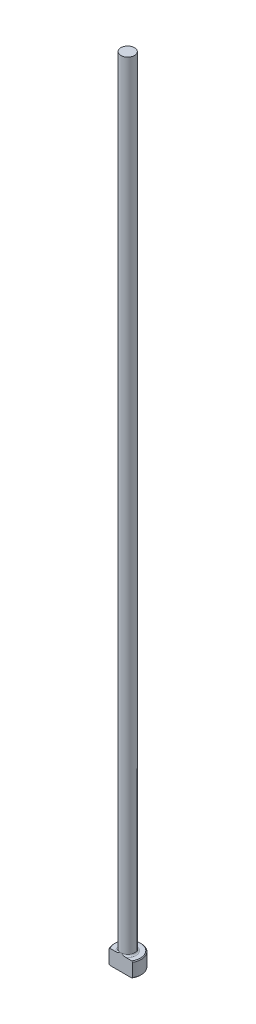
ISO-10303-21;
HEADER;
FILE_DESCRIPTION(('STEP AP214'),'2;1');
FILE_NAME('part.step','',(''),(''),'','','');
FILE_SCHEMA(('AUTOMOTIVE_DESIGN { 1 0 10303 214 1 1 1 1 }'));
ENDSEC;
DATA;
#1=APPLICATION_CONTEXT('core data for automotive mechanical design processes');
#2=APPLICATION_PROTOCOL_DEFINITION('international standard','automotive_design',2000,#1);
#3=PRODUCT_CONTEXT('',#1,'mechanical');
#4=PRODUCT('Part','Part','',(#3));
#5=PRODUCT_RELATED_PRODUCT_CATEGORY('part','',(#4));
#6=PRODUCT_DEFINITION_FORMATION('','',#4);
#7=PRODUCT_DEFINITION_CONTEXT('part definition',#1,'design');
#8=PRODUCT_DEFINITION('design','',#6,#7);
#9=PRODUCT_DEFINITION_SHAPE('','',#8);
#10=(LENGTH_UNIT() NAMED_UNIT(*) SI_UNIT(.MILLI.,.METRE.));
#11=(NAMED_UNIT(*) PLANE_ANGLE_UNIT() SI_UNIT($,.RADIAN.));
#12=(NAMED_UNIT(*) SI_UNIT($,.STERADIAN.) SOLID_ANGLE_UNIT());
#13=UNCERTAINTY_MEASURE_WITH_UNIT(LENGTH_MEASURE(1.E-05),#10,'distance_accuracy_value','');
#14=(GEOMETRIC_REPRESENTATION_CONTEXT(3) GLOBAL_UNCERTAINTY_ASSIGNED_CONTEXT((#13)) GLOBAL_UNIT_ASSIGNED_CONTEXT((#10,
#11,#12)) REPRESENTATION_CONTEXT('',''));
#15=CARTESIAN_POINT('',(0.,0.,0.));
#16=DIRECTION('',(0.,0.,1.));
#17=DIRECTION('',(1.,0.,0.));
#18=AXIS2_PLACEMENT_3D('',#15,#16,#17);
#19=CARTESIAN_POINT('',(0.,0.,0.));
#20=DIRECTION('',(0.,-1.,0.));
#21=DIRECTION('',(0.,0.,-1.));
#22=AXIS2_PLACEMENT_3D('',#19,#20,#21);
#23=PLANE('',#22);
#24=CARTESIAN_POINT('',(0.,0.,0.));
#25=DIRECTION('',(0.,-1.,0.));
#26=DIRECTION('',(0.,0.,-1.));
#27=AXIS2_PLACEMENT_3D('',#24,#25,#26);
#28=CIRCLE('',#27,4.10209999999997);
#29=CARTESIAN_POINT('',(-3.47371722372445,0.,2.18185999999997));
#30=VERTEX_POINT('',#29);
#31=CARTESIAN_POINT('',(3.47371722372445,0.,2.18185999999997));
#32=VERTEX_POINT('',#31);
#33=EDGE_CURVE('E98',#30,#32,#28,.T.);
#34=ORIENTED_EDGE('',*,*,#33,.T.);
#35=DIRECTION('',(-1.,0.,0.));
#36=VECTOR('',#35,1.);
#37=CARTESIAN_POINT('',(-3.77029099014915,0.,2.18185999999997));
#38=LINE('',#37,#36);
#39=EDGE_CURVE('E83',#32,#30,#38,.T.);
#40=ORIENTED_EDGE('',*,*,#39,.T.);
#41=EDGE_LOOP('',(#34,#40));
#42=FACE_BOUND('',#41,.T.);
#43=ADVANCED_FACE('F32',(#42),#23,.T.);
#44=CARTESIAN_POINT('',(0.,259.958771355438,0.));
#45=DIRECTION('',(0.,1.,0.));
#46=DIRECTION('',(0.,0.,1.));
#47=AXIS2_PLACEMENT_3D('',#44,#45,#46);
#48=CYLINDRICAL_SURFACE('',#47,4.35609999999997);
#49=CARTESIAN_POINT('',(0.,4.49580000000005,0.));
#50=DIRECTION('',(0.,1.,0.));
#51=DIRECTION('',(0.,0.,1.));
#52=AXIS2_PLACEMENT_3D('',#49,#50,#51);
#53=CIRCLE('',#52,4.35609999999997);
#54=CARTESIAN_POINT('',(-3.77029099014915,4.49580000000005,2.18185999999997));
#55=VERTEX_POINT('',#54);
#56=CARTESIAN_POINT('',(3.77029099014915,4.49580000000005,2.18185999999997));
#57=VERTEX_POINT('',#56);
#58=EDGE_CURVE('E104',#55,#57,#53,.F.);
#59=ORIENTED_EDGE('',*,*,#58,.T.);
#60=DIRECTION('',(0.,-1.,0.));
#61=VECTOR('',#60,1.);
#62=CARTESIAN_POINT('',(3.77029099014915,254.,2.18185999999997));
#63=LINE('',#62,#61);
#64=CARTESIAN_POINT('',(3.77029099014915,0.253999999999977,2.18185999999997));
#65=VERTEX_POINT('',#64);
#66=EDGE_CURVE('E183',#57,#65,#63,.T.);
#67=ORIENTED_EDGE('',*,*,#66,.T.);
#68=CARTESIAN_POINT('',(0.,0.253999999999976,0.));
#69=DIRECTION('',(0.,-1.,0.));
#70=DIRECTION('',(0.,0.,-1.));
#71=AXIS2_PLACEMENT_3D('',#68,#69,#70);
#72=CIRCLE('',#71,4.35609999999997);
#73=CARTESIAN_POINT('',(-3.77029099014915,0.253999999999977,2.18185999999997));
#74=VERTEX_POINT('',#73);
#75=EDGE_CURVE('E100',#65,#74,#72,.F.);
#76=ORIENTED_EDGE('',*,*,#75,.T.);
#77=DIRECTION('',(0.,-1.,0.));
#78=VECTOR('',#77,1.);
#79=CARTESIAN_POINT('',(-3.77029099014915,254.,2.18185999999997));
#80=LINE('',#79,#78);
#81=EDGE_CURVE('E93',#55,#74,#80,.T.);
#82=ORIENTED_EDGE('',*,*,#81,.F.);
#83=EDGE_LOOP('',(#59,#67,#76,#82));
#84=FACE_BOUND('',#83,.T.);
#85=ADVANCED_FACE('F158',(#84),#48,.T.);
#86=CARTESIAN_POINT('',(-4.35609999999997,4.7498,0.));
#87=DIRECTION('',(0.,1.,0.));
#88=DIRECTION('',(0.,0.,1.));
#89=AXIS2_PLACEMENT_3D('',#86,#87,#88);
#90=PLANE('',#89);
#91=CARTESIAN_POINT('',(0.,4.7498,0.));
#92=DIRECTION('',(0.,1.,0.));
#93=DIRECTION('',(0.,0.,1.));
#94=AXIS2_PLACEMENT_3D('',#91,#92,#93);
#95=CIRCLE('',#94,4.10210000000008);
#96=CARTESIAN_POINT('',(3.47371722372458,4.7498,2.18185999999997));
#97=VERTEX_POINT('',#96);
#98=CARTESIAN_POINT('',(-3.47371722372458,4.7498,2.18185999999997));
#99=VERTEX_POINT('',#98);
#100=EDGE_CURVE('E178',#97,#99,#95,.T.);
#101=ORIENTED_EDGE('',*,*,#100,.T.);
#102=DIRECTION('',(1.,0.,0.));
#103=VECTOR('',#102,1.);
#104=CARTESIAN_POINT('',(-4.35609999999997,4.7498,2.18185999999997));
#105=LINE('',#104,#103);
#106=CARTESIAN_POINT('',(-1.57316043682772,4.74979999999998,2.18185999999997));
#107=VERTEX_POINT('',#106);
#108=EDGE_CURVE('E57',#99,#107,#105,.T.);
#109=ORIENTED_EDGE('',*,*,#108,.T.);
#110=CARTESIAN_POINT('',(0.,4.7498,0.));
#111=DIRECTION('',(0.,1.,0.));
#112=DIRECTION('',(0.,0.,1.));
#113=AXIS2_PLACEMENT_3D('',#110,#111,#112);
#114=CIRCLE('',#113,2.68985999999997);
#115=CARTESIAN_POINT('',(1.573160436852,4.74979999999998,2.18185999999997));
#116=VERTEX_POINT('',#115);
#117=EDGE_CURVE('E107',#107,#116,#114,.F.);
#118=ORIENTED_EDGE('',*,*,#117,.T.);
#119=EDGE_CURVE('E136',#116,#97,#105,.T.);
#120=ORIENTED_EDGE('',*,*,#119,.T.);
#121=EDGE_LOOP('',(#101,#109,#118,#120));
#122=FACE_BOUND('',#121,.T.);
#123=ADVANCED_FACE('F147',(#122),#90,.T.);
#124=CARTESIAN_POINT('',(0.,4.74980000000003,0.));
#125=DIRECTION('',(0.,-1.,0.));
#126=DIRECTION('',(0.,0.,-1.));
#127=AXIS2_PLACEMENT_3D('',#124,#125,#126);
#128=CONICAL_SURFACE('',#127,4.10210000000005,0.785398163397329);
#129=ORIENTED_EDGE('',*,*,#58,.F.);
#130=CARTESIAN_POINT('',(-8.29740620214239,0.272420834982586,2.18185999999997));
#131=CARTESIAN_POINT('',(-8.11001658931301,0.453639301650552,2.18185999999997));
#132=CARTESIAN_POINT('',(-7.92243800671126,0.634663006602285,2.18185999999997));
#133=CARTESIAN_POINT('',(-7.54679112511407,0.996206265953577,2.18185999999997));
#134=CARTESIAN_POINT('',(-7.35872281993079,1.17672581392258,2.18185999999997));
#135=CARTESIAN_POINT('',(-6.98189454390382,1.53723233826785,2.18185999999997));
#136=CARTESIAN_POINT('',(-6.79313427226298,1.71721900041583,2.18185999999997));
#137=CARTESIAN_POINT('',(-6.4148611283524,2.07639786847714,2.18185999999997));
#138=CARTESIAN_POINT('',(-6.2253482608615,2.25559007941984,2.18185999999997));
#139=CARTESIAN_POINT('',(-5.84909618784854,2.60943040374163,2.18185999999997));
#140=CARTESIAN_POINT('',(-5.66237581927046,2.78409853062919,2.18185999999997));
#141=CARTESIAN_POINT('',(-5.28772586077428,3.13213263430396,2.18185999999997));
#142=CARTESIAN_POINT('',(-5.09979627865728,3.30549861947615,2.18185999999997));
#143=CARTESIAN_POINT('',(-4.72236000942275,3.65042687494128,2.18185999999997));
#144=CARTESIAN_POINT('',(-4.5328536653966,3.82198952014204,2.18185999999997));
#145=CARTESIAN_POINT('',(-4.15163095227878,4.16263740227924,2.18185999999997));
#146=CARTESIAN_POINT('',(-3.95991467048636,4.3317227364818,2.18185999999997));
#147=CARTESIAN_POINT('',(-3.64706429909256,4.6024261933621,2.18185999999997));
#148=CARTESIAN_POINT('',(-3.52690773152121,4.70517252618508,2.18185999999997));
#149=CARTESIAN_POINT('',(-3.28503549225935,4.90884238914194,2.18185999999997));
#150=CARTESIAN_POINT('',(-3.16331966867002,5.00976573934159,2.18185999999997));
#151=CARTESIAN_POINT('',(-2.91660195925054,5.21021849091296,2.18185999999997));
#152=CARTESIAN_POINT('',(-2.79157897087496,5.30972204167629,2.18185999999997));
#153=CARTESIAN_POINT('',(-2.53888352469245,5.50525493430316,2.18185999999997));
#154=CARTESIAN_POINT('',(-2.41121171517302,5.60128511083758,2.18185999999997));
#155=CARTESIAN_POINT('',(-2.15031743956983,5.78986115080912,2.18185999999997));
#156=CARTESIAN_POINT('',(-2.01704024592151,5.88233241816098,2.18185999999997));
#157=CARTESIAN_POINT('',(-1.81327157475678,6.01538041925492,2.18185999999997));
#158=CARTESIAN_POINT('',(-1.74465155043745,6.05881824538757,2.18185999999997));
#159=CARTESIAN_POINT('',(-1.60595312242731,6.14329074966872,2.18185999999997));
#160=CARTESIAN_POINT('',(-1.53587488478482,6.1843256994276,2.18185999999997));
#161=CARTESIAN_POINT('',(-1.39488743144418,6.26291464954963,2.18185999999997));
#162=CARTESIAN_POINT('',(-1.32399872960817,6.30050495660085,2.18185999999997));
#163=CARTESIAN_POINT('',(-1.18039263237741,6.3719902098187,2.18185999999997));
#164=CARTESIAN_POINT('',(-1.1076749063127,6.40588448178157,2.18185999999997));
#165=CARTESIAN_POINT('',(-0.886859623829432,6.50042910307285,2.18185999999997));
#166=CARTESIAN_POINT('',(-0.735568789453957,6.55425288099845,2.18185999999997));
#167=CARTESIAN_POINT('',(-0.508759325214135,6.61258906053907,2.18185999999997));
#168=CARTESIAN_POINT('',(-0.436032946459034,6.62807472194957,2.18185999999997));
#169=CARTESIAN_POINT('',(-0.289417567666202,6.65211468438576,2.18185999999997));
#170=CARTESIAN_POINT('',(-0.215528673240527,6.66066961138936,2.18185999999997));
#171=CARTESIAN_POINT('',(-0.067491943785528,6.67024200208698,2.18185999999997));
#172=CARTESIAN_POINT('',(0.00665433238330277,6.67128322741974,2.18185999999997));
#173=CARTESIAN_POINT('',(0.154669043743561,6.66581579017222,2.18185999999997));
#174=CARTESIAN_POINT('',(0.228537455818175,6.65930651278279,2.18185999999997));
#175=CARTESIAN_POINT('',(0.374663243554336,6.63928031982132,2.18185999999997));
#176=CARTESIAN_POINT('',(0.446928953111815,6.62582298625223,2.18185999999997));
#177=CARTESIAN_POINT('',(0.590020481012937,6.59274386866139,2.18185999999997));
#178=CARTESIAN_POINT('',(0.66084612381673,6.57312133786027,2.18185999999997));
#179=CARTESIAN_POINT('',(0.801226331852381,6.52853699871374,2.18185999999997));
#180=CARTESIAN_POINT('',(0.870771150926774,6.50354490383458,2.18185999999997));
#181=CARTESIAN_POINT('',(1.00810988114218,6.44922929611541,2.18185999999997));
#182=CARTESIAN_POINT('',(1.07590414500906,6.41990666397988,2.18185999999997));
#183=CARTESIAN_POINT('',(1.27697865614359,6.3266243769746,2.18185999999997));
#184=CARTESIAN_POINT('',(1.40780883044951,6.2573989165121,2.18185999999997));
#185=CARTESIAN_POINT('',(1.66424130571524,6.10977815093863,2.18185999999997));
#186=CARTESIAN_POINT('',(1.78983676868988,6.0313713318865,2.18185999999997));
#187=CARTESIAN_POINT('',(2.03744033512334,5.8681111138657,2.18185999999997));
#188=CARTESIAN_POINT('',(2.15943237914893,5.7832335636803,2.18185999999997));
#189=CARTESIAN_POINT('',(2.40024229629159,5.60925236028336,2.18185999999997));
#190=CARTESIAN_POINT('',(2.51906172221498,5.52015083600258,2.18185999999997));
#191=CARTESIAN_POINT('',(2.75587860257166,5.33769803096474,2.18185999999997));
#192=CARTESIAN_POINT('',(2.87384473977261,5.24430629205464,2.18185999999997));
#193=CARTESIAN_POINT('',(3.1079163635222,5.05520318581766,2.18185999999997));
#194=CARTESIAN_POINT('',(3.22402164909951,4.95949157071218,2.18185999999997));
#195=CARTESIAN_POINT('',(3.45448747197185,4.76655584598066,2.18185999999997));
#196=CARTESIAN_POINT('',(3.568851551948,4.66933595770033,2.18185999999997));
#197=CARTESIAN_POINT('',(3.79642074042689,4.47354772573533,2.18185999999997));
#198=CARTESIAN_POINT('',(3.90962582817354,4.3749793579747,2.18185999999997));
#199=CARTESIAN_POINT('',(4.20944197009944,4.11144413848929,2.18185999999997));
#200=CARTESIAN_POINT('',(4.39523734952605,3.94555000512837,2.18185999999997));
#201=CARTESIAN_POINT('',(4.76499498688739,3.61172799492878,2.18185999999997));
#202=CARTESIAN_POINT('',(4.94895719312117,3.44380006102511,2.18185999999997));
#203=CARTESIAN_POINT('',(5.315687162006,3.10630207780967,2.18185999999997));
#204=CARTESIAN_POINT('',(5.49845363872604,2.93673063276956,2.18185999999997));
#205=CARTESIAN_POINT('',(5.86294512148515,2.59647225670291,2.18185999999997));
#206=CARTESIAN_POINT('',(6.04467012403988,2.42578532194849,2.18185999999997));
#207=CARTESIAN_POINT('',(6.39984904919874,2.0905925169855,2.18185999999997));
#208=CARTESIAN_POINT('',(6.57333566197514,1.92612126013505,2.18185999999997));
#209=CARTESIAN_POINT('',(6.91971225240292,1.59655063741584,2.18185999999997));
#210=CARTESIAN_POINT('',(7.09260222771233,1.43145126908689,2.18185999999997));
#211=CARTESIAN_POINT('',(7.43770557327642,1.10093162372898,2.18185999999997));
#212=CARTESIAN_POINT('',(7.60991948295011,0.935511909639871,2.18185999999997));
#213=CARTESIAN_POINT('',(7.95394433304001,0.60425675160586,2.18185999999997));
#214=CARTESIAN_POINT('',(8.1257552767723,0.438421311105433,2.18185999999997));
#215=CARTESIAN_POINT('',(8.29740620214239,0.272420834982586,2.18185999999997));
#216=B_SPLINE_CURVE_WITH_KNOTS('',3,(#130,#131,#132,#133,#134,#135,#136,#137,#138,#139,#140,
#141,#142,#143,#144,#145,#146,#147,#148,#149,#150,#151,#152,#153,#154,#155,#156,#157,#158,#159,
#160,#161,#162,#163,#164,#165,#166,#167,#168,#169,#170,#171,#172,#173,#174,#175,#176,#177,#178,
#179,#180,#181,#182,#183,#184,#185,#186,#187,#188,#189,#190,#191,#192,#193,#194,#195,#196,#197,
#198,#199,#200,#201,#202,#203,#204,#205,#206,#207,#208,#209,#210,#211,#212,#213,#214,#215),
.UNSPECIFIED.,.F.,.F.,(4,2,2,2,2,2,2,2,2,2,2,2,2,2,2,2,2,2,2,2,2,2,2,2,2,2,2,2,2,2,2,2,2,2,2,2,
2,2,2,2,2,2,4),(0.,0.782045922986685,1.56410177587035,2.34655173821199,3.12899674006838,
3.89603924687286,4.66307681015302,5.42995162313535,6.19679624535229,6.67107131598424,
7.14539294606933,7.62470673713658,8.10390457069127,8.59034482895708,8.83394496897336,
9.07751752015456,9.31812371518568,9.55877372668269,10.0382345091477,10.2610326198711,
10.4838106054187,10.7058837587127,10.9279749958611,11.14819259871,11.3684368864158,
11.5899576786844,11.8114334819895,12.2548321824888,12.698793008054,13.1445006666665,
13.589986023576,14.0413251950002,14.4927127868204,14.9430078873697,15.3933110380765,
16.1405265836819,16.8877631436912,17.6357023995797,18.3836441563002,19.1008141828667,
19.8179870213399,20.5343603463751,21.250727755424),.UNSPECIFIED.);
#217=EDGE_CURVE('E135',#55,#99,#216,.T.);
#218=ORIENTED_EDGE('',*,*,#217,.T.);
#219=ORIENTED_EDGE('',*,*,#100,.F.);
#220=EDGE_CURVE('E127',#97,#57,#216,.T.);
#221=ORIENTED_EDGE('',*,*,#220,.T.);
#222=EDGE_LOOP('',(#129,#218,#219,#221));
#223=FACE_BOUND('',#222,.T.);
#224=ADVANCED_FACE('F143',(#223),#128,.T.);
#225=CARTESIAN_POINT('',(0.,0.253999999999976,0.));
#226=DIRECTION('',(0.,1.,0.));
#227=DIRECTION('',(0.,0.,1.));
#228=AXIS2_PLACEMENT_3D('',#225,#226,#227);
#229=CONICAL_SURFACE('',#228,4.35609999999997,0.785398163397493);
#230=ORIENTED_EDGE('',*,*,#75,.F.);
#231=CARTESIAN_POINT('',(8.29740620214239,4.47737916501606,2.18185999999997));
#232=CARTESIAN_POINT('',(8.11001658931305,4.29616069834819,2.18185999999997));
#233=CARTESIAN_POINT('',(7.92243800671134,4.11513699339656,2.18185999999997));
#234=CARTESIAN_POINT('',(7.54679112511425,3.75359373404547,2.18185999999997));
#235=CARTESIAN_POINT('',(7.35872281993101,3.57307418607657,2.18185999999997));
#236=CARTESIAN_POINT('',(6.98189454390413,3.21256766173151,2.18185999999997));
#237=CARTESIAN_POINT('',(6.79313427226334,3.03258099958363,2.18185999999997));
#238=CARTESIAN_POINT('',(6.41486112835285,2.67340213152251,2.18185999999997));
#239=CARTESIAN_POINT('',(6.22534826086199,2.49420992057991,2.18185999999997));
#240=CARTESIAN_POINT('',(5.84909618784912,2.14036959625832,2.18185999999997));
#241=CARTESIAN_POINT('',(5.66237581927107,1.96570146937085,2.18185999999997));
#242=CARTESIAN_POINT('',(5.28772586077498,1.61766736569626,2.18185999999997));
#243=CARTESIAN_POINT('',(5.09979627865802,1.44430138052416,2.18185999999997));
#244=CARTESIAN_POINT('',(4.72236000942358,1.09937312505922,2.18185999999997));
#245=CARTESIAN_POINT('',(4.53285366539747,0.927810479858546,2.18185999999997));
#246=CARTESIAN_POINT('',(4.15163095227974,0.587162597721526,2.18185999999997));
#247=CARTESIAN_POINT('',(3.95991467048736,0.418077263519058,2.18185999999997));
#248=CARTESIAN_POINT('',(3.64706429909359,0.147373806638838,2.18185999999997));
#249=CARTESIAN_POINT('',(3.5269077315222,0.0446274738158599,2.18185999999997));
#250=CARTESIAN_POINT('',(3.28503549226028,-0.159042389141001,2.18185999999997));
#251=CARTESIAN_POINT('',(3.16331966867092,-0.25996573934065,2.18185999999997));
#252=CARTESIAN_POINT('',(2.91660195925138,-0.46041849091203,2.18185999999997));
#253=CARTESIAN_POINT('',(2.79157897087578,-0.559922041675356,2.18185999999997));
#254=CARTESIAN_POINT('',(2.53888352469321,-0.755454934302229,2.18185999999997));
#255=CARTESIAN_POINT('',(2.41121171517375,-0.851485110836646,2.18185999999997));
#256=CARTESIAN_POINT('',(2.15031743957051,-1.04006115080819,2.18185999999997));
#257=CARTESIAN_POINT('',(2.01704024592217,-1.13253241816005,2.18185999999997));
#258=CARTESIAN_POINT('',(1.81327157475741,-1.265580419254,2.18185999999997));
#259=CARTESIAN_POINT('',(1.74465155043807,-1.30901824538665,2.18185999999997));
#260=CARTESIAN_POINT('',(1.6059531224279,-1.3934907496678,2.18185999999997));
#261=CARTESIAN_POINT('',(1.5358748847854,-1.43452569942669,2.18185999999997));
#262=CARTESIAN_POINT('',(1.39488743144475,-1.51311464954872,2.18185999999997));
#263=CARTESIAN_POINT('',(1.32399872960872,-1.55070495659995,2.18185999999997));
#264=CARTESIAN_POINT('',(1.18039263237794,-1.62219020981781,2.18185999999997));
#265=CARTESIAN_POINT('',(1.10767490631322,-1.65608448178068,2.18185999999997));
#266=CARTESIAN_POINT('',(0.886859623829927,-1.75062910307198,2.18185999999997));
#267=CARTESIAN_POINT('',(0.735568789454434,-1.8044528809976,2.18185999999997));
#268=CARTESIAN_POINT('',(0.508759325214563,-1.86278906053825,2.18185999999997));
#269=CARTESIAN_POINT('',(0.43603294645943,-1.87827472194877,2.18185999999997));
#270=CARTESIAN_POINT('',(0.289417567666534,-1.90231468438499,2.18185999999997));
#271=CARTESIAN_POINT('',(0.215528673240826,-1.91086961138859,2.18185999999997));
#272=CARTESIAN_POINT('',(0.0674919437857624,-1.92044200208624,2.18185999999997));
#273=CARTESIAN_POINT('',(-0.00665433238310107,-1.921483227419,2.18185999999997));
#274=CARTESIAN_POINT('',(-0.154669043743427,-1.91601579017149,2.18185999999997));
#275=CARTESIAN_POINT('',(-0.228537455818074,-1.90950651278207,2.18185999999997));
#276=CARTESIAN_POINT('',(-0.374663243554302,-1.8894803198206,2.18185999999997));
#277=CARTESIAN_POINT('',(-0.446928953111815,-1.87602298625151,2.18185999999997));
#278=CARTESIAN_POINT('',(-0.590020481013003,-1.84294386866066,2.18185999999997));
#279=CARTESIAN_POINT('',(-0.660846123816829,-1.82332133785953,2.18185999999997));
#280=CARTESIAN_POINT('',(-0.801226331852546,-1.77873699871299,2.18185999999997));
#281=CARTESIAN_POINT('',(-0.870771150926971,-1.75374490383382,2.18185999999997));
#282=CARTESIAN_POINT('',(-1.00810988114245,-1.69942929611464,2.18185999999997));
#283=CARTESIAN_POINT('',(-1.07590414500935,-1.67010666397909,2.18185999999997));
#284=CARTESIAN_POINT('',(-1.27697865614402,-1.57682437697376,2.18185999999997));
#285=CARTESIAN_POINT('',(-1.40780883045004,-1.50759891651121,2.18185999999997));
#286=CARTESIAN_POINT('',(-1.66424130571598,-1.35997815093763,2.18185999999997));
#287=CARTESIAN_POINT('',(-1.78983676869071,-1.28157133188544,2.18185999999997));
#288=CARTESIAN_POINT('',(-2.03744033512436,-1.11831111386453,2.18185999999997));
#289=CARTESIAN_POINT('',(-2.15943237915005,-1.03343356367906,2.18185999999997));
#290=CARTESIAN_POINT('',(-2.4002422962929,-0.859452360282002,2.18185999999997));
#291=CARTESIAN_POINT('',(-2.51906172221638,-0.770350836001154,2.18185999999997));
#292=CARTESIAN_POINT('',(-2.75587860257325,-0.587898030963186,2.18185999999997));
#293=CARTESIAN_POINT('',(-2.87384473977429,-0.494506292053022,2.18185999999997));
#294=CARTESIAN_POINT('',(-3.10791636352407,-0.305403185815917,2.18185999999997));
#295=CARTESIAN_POINT('',(-3.22402164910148,-0.209691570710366,2.18185999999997));
#296=CARTESIAN_POINT('',(-3.45448747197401,-0.0167558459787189,2.18185999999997));
#297=CARTESIAN_POINT('',(-3.56885155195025,0.0804640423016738,2.18185999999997));
#298=CARTESIAN_POINT('',(-3.79642074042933,0.2762522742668,2.18185999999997));
#299=CARTESIAN_POINT('',(-3.90962582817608,0.374820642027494,2.18185999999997));
#300=CARTESIAN_POINT('',(-4.20944197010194,0.63835586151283,2.18185999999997));
#301=CARTESIAN_POINT('',(-4.39523734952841,0.804249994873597,2.18185999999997));
#302=CARTESIAN_POINT('',(-4.76499498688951,1.13807200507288,2.18185999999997));
#303=CARTESIAN_POINT('',(-4.94895719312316,1.3059999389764,2.18185999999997));
#304=CARTESIAN_POINT('',(-5.31568716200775,1.64349792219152,2.18185999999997));
#305=CARTESIAN_POINT('',(-5.49845363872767,1.81306936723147,2.18185999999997));
#306=CARTESIAN_POINT('',(-5.86294512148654,2.1533277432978,2.18185999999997));
#307=CARTESIAN_POINT('',(-6.04467012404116,2.32401467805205,2.18185999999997));
#308=CARTESIAN_POINT('',(-6.3998490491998,2.65920748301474,2.18185999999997));
#309=CARTESIAN_POINT('',(-6.5733356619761,2.82367873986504,2.18185999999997));
#310=CARTESIAN_POINT('',(-6.91971225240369,3.15324936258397,2.18185999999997));
#311=CARTESIAN_POINT('',(-7.092602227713,3.31834873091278,2.18185999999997));
#312=CARTESIAN_POINT('',(-7.4377055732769,3.6488683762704,2.18185999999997));
#313=CARTESIAN_POINT('',(-7.60991948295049,3.81428809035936,2.18185999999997));
#314=CARTESIAN_POINT('',(-7.9539443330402,4.14554324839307,2.18185999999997));
#315=CARTESIAN_POINT('',(-8.1257552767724,4.31137868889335,2.18185999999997));
#316=CARTESIAN_POINT('',(-8.29740620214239,4.47737916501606,2.18185999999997));
#317=B_SPLINE_CURVE_WITH_KNOTS('',3,(#231,#232,#233,#234,#235,#236,#237,#238,#239,#240,#241,
#242,#243,#244,#245,#246,#247,#248,#249,#250,#251,#252,#253,#254,#255,#256,#257,#258,#259,#260,
#261,#262,#263,#264,#265,#266,#267,#268,#269,#270,#271,#272,#273,#274,#275,#276,#277,#278,#279,
#280,#281,#282,#283,#284,#285,#286,#287,#288,#289,#290,#291,#292,#293,#294,#295,#296,#297,#298,
#299,#300,#301,#302,#303,#304,#305,#306,#307,#308,#309,#310,#311,#312,#313,#314,#315,#316),
.UNSPECIFIED.,.F.,.F.,(4,2,2,2,2,2,2,2,2,2,2,2,2,2,2,2,2,2,2,2,2,2,2,2,2,2,2,2,2,2,2,2,2,2,2,2,
2,2,2,2,2,2,4),(0.,0.782045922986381,1.56410177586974,2.34655173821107,3.12899674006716,
3.89603924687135,4.66307681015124,5.42995162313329,6.19679624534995,6.67107131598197,
7.14539294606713,7.62470673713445,8.10390457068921,8.59034482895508,8.83394496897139,
9.07751752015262,9.31812371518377,9.55877372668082,10.0382345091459,10.2610326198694,
10.4838106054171,10.7058837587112,10.9279749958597,11.1481925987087,11.3684368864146,
11.5899576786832,11.8114334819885,12.2548321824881,12.6987930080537,13.1445006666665,
13.5899860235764,14.0413251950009,14.4927127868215,14.9430078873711,15.3933110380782,
16.1405265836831,16.8877631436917,17.6357023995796,18.3836441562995,19.1008141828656,
19.8179870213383,20.5343603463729,21.2507277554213),.UNSPECIFIED.);
#318=EDGE_CURVE('E86',#65,#32,#317,.T.);
#319=ORIENTED_EDGE('',*,*,#318,.T.);
#320=ORIENTED_EDGE('',*,*,#33,.F.);
#321=EDGE_CURVE('E89',#30,#74,#317,.T.);
#322=ORIENTED_EDGE('',*,*,#321,.T.);
#323=EDGE_LOOP('',(#230,#319,#320,#322));
#324=FACE_BOUND('',#323,.T.);
#325=ADVANCED_FACE('F97',(#324),#229,.T.);
#326=CARTESIAN_POINT('',(0.,5.25779999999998,0.));
#327=DIRECTION('',(0.,1.,0.));
#328=DIRECTION('',(0.,0.,1.));
#329=AXIS2_PLACEMENT_3D('',#326,#327,#328);
#330=TOROIDAL_SURFACE('',#329,2.68985999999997,0.508);
#331=CARTESIAN_POINT('',(0.,5.25779999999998,2.18185999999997));
#332=CARTESIAN_POINT('',(6.76236332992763E-12,5.25780082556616,2.18185999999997));
#333=CARTESIAN_POINT('',(1.36820520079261E-07,5.25780165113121,2.18185999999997));
#334=CARTESIAN_POINT('',(5.89578630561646E-07,5.25780325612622,2.18185999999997));
#335=CARTESIAN_POINT('',(9.08234574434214E-07,5.25780403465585,2.18185999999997));
#336=CARTESIAN_POINT('',(1.68092475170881E-06,5.25780557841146,2.18185999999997));
#337=CARTESIAN_POINT('',(2.14189275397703E-06,5.2578063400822,2.18185999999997));
#338=CARTESIAN_POINT('',(3.15002861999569E-06,5.25780779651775,2.18185999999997));
#339=CARTESIAN_POINT('',(3.6968011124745E-06,5.25780849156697,2.18185999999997));
#340=CARTESIAN_POINT('',(5.61337472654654E-06,5.25781074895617,2.18185999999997));
#341=CARTESIAN_POINT('',(7.09755065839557E-06,5.25781221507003,2.18185999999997));
#342=CARTESIAN_POINT('',(1.02114574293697E-05,5.25781489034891,2.18185999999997));
#343=CARTESIAN_POINT('',(1.18369729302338E-05,5.25781610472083,2.18185999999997));
#344=CARTESIAN_POINT('',(1.79893918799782E-05,5.25782048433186,2.18185999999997));
#345=CARTESIAN_POINT('',(2.26931740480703E-05,5.25782340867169,2.18185999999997));
#346=CARTESIAN_POINT('',(3.21201703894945E-05,5.25782836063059,2.18185999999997));
#347=CARTESIAN_POINT('',(3.68190317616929E-05,5.25783043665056,2.18185999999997));
#348=CARTESIAN_POINT('',(5.6271345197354E-05,5.25783892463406,2.18185999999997));
#349=CARTESIAN_POINT('',(7.11006852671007E-05,5.2578451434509,2.18185999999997));
#350=CARTESIAN_POINT('',(9.91946288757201E-05,5.25785544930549,2.18185999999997));
#351=CARTESIAN_POINT('',(0.000112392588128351,5.25785971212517,2.18185999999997));
#352=CARTESIAN_POINT('',(0.000205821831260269,5.25789253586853,2.18185999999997));
#353=CARTESIAN_POINT('',(0.000281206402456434,5.25793316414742,2.18185999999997));
#354=CARTESIAN_POINT('',(0.000570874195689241,5.25808334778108,2.18185999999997));
#355=CARTESIAN_POINT('',(0.000788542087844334,5.25818394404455,2.18185999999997));
#356=CARTESIAN_POINT('',(0.00162139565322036,5.2585748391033,2.18185999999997));
#357=CARTESIAN_POINT('',(0.00223309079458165,5.25887451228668,2.18185999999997));
#358=CARTESIAN_POINT('',(0.00469859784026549,5.26007628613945,2.18185999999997));
#359=CARTESIAN_POINT('',(0.00655625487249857,5.26096791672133,2.18185999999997));
#360=CARTESIAN_POINT('',(0.0499955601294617,5.2818252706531,2.18185999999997));
#361=CARTESIAN_POINT('',(0.0915276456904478,5.30192833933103,2.18185999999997));
#362=CARTESIAN_POINT('',(0.173288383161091,5.34113945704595,2.18185999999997));
#363=CARTESIAN_POINT('',(0.213512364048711,5.36025785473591,2.18185999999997));
#364=CARTESIAN_POINT('',(0.298558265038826,5.40018110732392,2.18185999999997));
#365=CARTESIAN_POINT('',(0.343401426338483,5.42094143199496,2.18185999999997));
#366=CARTESIAN_POINT('',(0.433873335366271,5.461876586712,2.18185999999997));
#367=CARTESIAN_POINT('',(0.479505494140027,5.48204391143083,2.18185999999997));
#368=CARTESIAN_POINT('',(0.560126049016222,5.51653204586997,2.18185999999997));
#369=CARTESIAN_POINT('',(0.595014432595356,5.53108546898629,2.18185999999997));
#370=CARTESIAN_POINT('',(0.665022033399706,5.5593862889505,2.18185999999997));
#371=CARTESIAN_POINT('',(0.700140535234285,5.57313546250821,2.18185999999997));
#372=CARTESIAN_POINT('',(0.804605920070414,5.61247110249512,2.18185999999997));
#373=CARTESIAN_POINT('',(0.874458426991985,5.63675521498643,2.18185999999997));
#374=CARTESIAN_POINT('',(0.985787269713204,5.67121120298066,2.18185999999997));
#375=CARTESIAN_POINT('',(1.02675946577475,5.68300561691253,2.18185999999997));
#376=CARTESIAN_POINT('',(1.1093972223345,5.70472205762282,2.18185999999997));
#377=CARTESIAN_POINT('',(1.15106514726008,5.71463495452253,2.18185999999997));
#378=CARTESIAN_POINT('',(1.28086453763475,5.74181032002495,2.18185999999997));
#379=CARTESIAN_POINT('',(1.36989744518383,5.75522986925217,2.18185999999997));
#380=CARTESIAN_POINT('',(1.52600251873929,5.7664029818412,2.18185999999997));
#381=CARTESIAN_POINT('',(1.59283859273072,5.76729615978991,2.18185999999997));
#382=CARTESIAN_POINT('',(1.72519048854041,5.75915147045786,2.18185999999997));
#383=CARTESIAN_POINT('',(1.79071197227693,5.75024711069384,2.18185999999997));
#384=CARTESIAN_POINT('',(1.89432073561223,5.72580547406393,2.18185999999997));
#385=CARTESIAN_POINT('',(1.93330975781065,5.71411139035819,2.18185999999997));
#386=CARTESIAN_POINT('',(2.00932193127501,5.68520477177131,2.18185999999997));
#387=CARTESIAN_POINT('',(2.04634275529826,5.6679858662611,2.18185999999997));
#388=CARTESIAN_POINT('',(2.10879882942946,5.63197070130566,2.18185999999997));
#389=CARTESIAN_POINT('',(2.13495201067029,5.61442756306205,2.18185999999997));
#390=CARTESIAN_POINT('',(2.18414136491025,5.5754122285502,2.18185999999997));
#391=CARTESIAN_POINT('',(2.20718331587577,5.55394749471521,2.18185999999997));
#392=CARTESIAN_POINT('',(2.24438562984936,5.51217917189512,2.18185999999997));
#393=CARTESIAN_POINT('',(2.25938896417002,5.49262928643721,2.18185999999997));
#394=CARTESIAN_POINT('',(2.28600795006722,5.45132434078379,2.18185999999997));
#395=CARTESIAN_POINT('',(2.2976249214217,5.42957014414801,2.18185999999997));
#396=CARTESIAN_POINT('',(2.31683043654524,5.38412987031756,2.18185999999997));
#397=CARTESIAN_POINT('',(2.32438734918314,5.3604302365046,2.18185999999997));
#398=CARTESIAN_POINT('',(2.3347479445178,5.31201262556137,2.18185999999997));
#399=CARTESIAN_POINT('',(2.3375552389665,5.28729543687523,2.18185999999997));
#400=CARTESIAN_POINT('',(2.33815176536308,5.24094501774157,2.18185999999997));
#401=CARTESIAN_POINT('',(2.33653117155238,5.2193174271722,2.18185999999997));
#402=CARTESIAN_POINT('',(2.32960732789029,5.1766662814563,2.18185999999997));
#403=CARTESIAN_POINT('',(2.32430446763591,5.15564266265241,2.18185999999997));
#404=CARTESIAN_POINT('',(2.31045890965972,5.11510468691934,2.18185999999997));
#405=CARTESIAN_POINT('',(2.30197288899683,5.09557073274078,2.18185999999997));
#406=CARTESIAN_POINT('',(2.28218969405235,5.0579936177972,2.18185999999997));
#407=CARTESIAN_POINT('',(2.27089152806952,5.03995098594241,2.18185999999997));
#408=CARTESIAN_POINT('',(2.24116864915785,4.99899475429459,2.18185999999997));
#409=CARTESIAN_POINT('',(2.22167110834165,4.97685825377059,2.18185999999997));
#410=CARTESIAN_POINT('',(2.17933025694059,4.93604234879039,2.18185999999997));
#411=CARTESIAN_POINT('',(2.15647938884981,4.91737097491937,2.18185999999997));
#412=CARTESIAN_POINT('',(2.09919492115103,4.8769289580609,2.18185999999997));
#413=CARTESIAN_POINT('',(2.06367385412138,4.85670401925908,2.18185999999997));
#414=CARTESIAN_POINT('',(1.98999517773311,4.82216208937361,2.18185999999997));
#415=CARTESIAN_POINT('',(1.95183902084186,4.80784187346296,2.18185999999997));
#416=CARTESIAN_POINT('',(1.85382033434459,4.77819525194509,2.18185999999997));
#417=CARTESIAN_POINT('',(1.79296033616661,4.76619647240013,2.18185999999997));
#418=CARTESIAN_POINT('',(1.66948296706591,4.75147766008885,2.18185999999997));
#419=CARTESIAN_POINT('',(1.60685300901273,4.74888182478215,2.18185999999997));
#420=CARTESIAN_POINT('',(1.4885719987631,4.75114195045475,2.18185999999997));
#421=CARTESIAN_POINT('',(1.43289931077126,4.75522174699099,2.18185999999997));
#422=CARTESIAN_POINT('',(1.32212384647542,4.76827949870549,2.18185999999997));
#423=CARTESIAN_POINT('',(1.26702143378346,4.77726040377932,2.18185999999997));
#424=CARTESIAN_POINT('',(1.1603339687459,4.7986485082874,2.18185999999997));
#425=CARTESIAN_POINT('',(1.10870958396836,4.81086463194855,2.18185999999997));
#426=CARTESIAN_POINT('',(1.00654345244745,4.83814415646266,2.18185999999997));
#427=CARTESIAN_POINT('',(0.95599723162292,4.85319104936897,2.18185999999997));
#428=CARTESIAN_POINT('',(0.838497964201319,4.89117217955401,2.18185999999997));
#429=CARTESIAN_POINT('',(0.771849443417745,4.91504347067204,2.18185999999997));
#430=CARTESIAN_POINT('',(0.67209070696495,4.95342467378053,2.18185999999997));
#431=CARTESIAN_POINT('',(0.63853151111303,4.96679790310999,2.18185999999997));
#432=CARTESIAN_POINT('',(0.571611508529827,4.99425046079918,2.18185999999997));
#433=CARTESIAN_POINT('',(0.538251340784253,5.00833135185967,2.18185999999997));
#434=CARTESIAN_POINT('',(0.460992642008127,5.04169869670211,2.18185999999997));
#435=CARTESIAN_POINT('',(0.417184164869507,5.06119272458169,2.18185999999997));
#436=CARTESIAN_POINT('',(0.330302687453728,5.1006984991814,2.18185999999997));
#437=CARTESIAN_POINT('',(0.287226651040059,5.12070359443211,2.18185999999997));
#438=CARTESIAN_POINT('',(0.20551723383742,5.15913848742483,2.18185999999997));
#439=CARTESIAN_POINT('',(0.166865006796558,5.17752887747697,2.18185999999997));
#440=CARTESIAN_POINT('',(0.0882929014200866,5.21523074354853,2.18185999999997));
#441=CARTESIAN_POINT('',(0.0483772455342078,5.23455160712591,2.18185999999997));
#442=CARTESIAN_POINT('',(0.0065563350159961,5.25463205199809,2.18185999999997));
#443=CARTESIAN_POINT('',(0.00469875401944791,5.25552364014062,2.18185999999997));
#444=CARTESIAN_POINT('',(0.00223326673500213,5.25672540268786,2.18185999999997));
#445=CARTESIAN_POINT('',(0.00162151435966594,5.25702510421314,2.18185999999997));
#446=CARTESIAN_POINT('',(0.000788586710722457,5.25741603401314,2.18185999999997));
#447=CARTESIAN_POINT('',(0.000570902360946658,5.25751663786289,2.18185999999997));
#448=CARTESIAN_POINT('',(0.000281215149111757,5.25766683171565,2.18185999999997));
#449=CARTESIAN_POINT('',(0.000205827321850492,5.25770746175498,2.18185999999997));
#450=CARTESIAN_POINT('',(0.000112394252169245,5.25774028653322,2.18185999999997));
#451=CARTESIAN_POINT('',(9.9196012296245E-05,5.25774454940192,2.18185999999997));
#452=CARTESIAN_POINT('',(7.11014678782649E-05,5.25775485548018,2.18185999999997));
#453=CARTESIAN_POINT('',(5.62718149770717E-05,5.25776107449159,2.18185999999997));
#454=CARTESIAN_POINT('',(3.68191491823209E-05,5.25776956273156,2.18185999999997));
#455=CARTESIAN_POINT('',(3.2120240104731E-05,5.25777163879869,2.18185999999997));
#456=CARTESIAN_POINT('',(2.26931565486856E-05,5.25777659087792,2.18185999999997));
#457=CARTESIAN_POINT('',(1.7989336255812E-05,5.25777951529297,2.18185999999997));
#458=CARTESIAN_POINT('',(1.18368827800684E-05,5.25778389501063,2.18185999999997));
#459=CARTESIAN_POINT('',(1.02113633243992E-05,5.25778510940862,2.18185999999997));
#460=CARTESIAN_POINT('',(7.09745398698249E-06,5.25778778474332,2.18185999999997));
#461=CARTESIAN_POINT('',(5.61327961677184E-06,5.25778925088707,2.18185999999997));
#462=CARTESIAN_POINT('',(3.69671456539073E-06,5.25779150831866,2.18185999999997));
#463=CARTESIAN_POINT('',(3.14994580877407E-06,5.25779220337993,2.18185999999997));
#464=CARTESIAN_POINT('',(2.14181954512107E-06,5.2577936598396,2.18185999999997));
#465=CARTESIAN_POINT('',(1.68085742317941E-06,5.25779442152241,2.18185999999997));
#466=CARTESIAN_POINT('',(9.08181554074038E-07,5.25779596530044,2.18185999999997));
#467=CARTESIAN_POINT('',(5.89533831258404E-07,5.25779674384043,2.18185999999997));
#468=CARTESIAN_POINT('',(1.36795510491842E-07,5.25779834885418,2.18185999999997));
#469=CARTESIAN_POINT('',(-6.76241374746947E-12,5.25779917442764,2.18185999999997));
#470=CARTESIAN_POINT('',(0.,5.25779999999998,2.18185999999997));
#471=B_SPLINE_CURVE_WITH_KNOTS('',3,(#331,#332,#333,#334,#335,#336,#337,#338,#339,#340,#341,
#342,#343,#344,#345,#346,#347,#348,#349,#350,#351,#352,#353,#354,#355,#356,#357,#358,#359,#360,
#361,#362,#363,#364,#365,#366,#367,#368,#369,#370,#371,#372,#373,#374,#375,#376,#377,#378,#379,
#380,#381,#382,#383,#384,#385,#386,#387,#388,#389,#390,#391,#392,#393,#394,#395,#396,#397,#398,
#399,#400,#401,#402,#403,#404,#405,#406,#407,#408,#409,#410,#411,#412,#413,#414,#415,#416,#417,
#418,#419,#420,#421,#422,#423,#424,#425,#426,#427,#428,#429,#430,#431,#432,#433,#434,#435,#436,
#437,#438,#439,#440,#441,#442,#443,#444,#445,#446,#447,#448,#449,#450,#451,#452,#453,#454,#455,
#456,#457,#458,#459,#460,#461,#462,#463,#464,#465,#466,#467,#468,#469,#470),.UNSPECIFIED.,.T.,
.F.,(4,2,2,2,2,2,2,2,2,2,2,2,2,2,2,2,2,2,2,2,2,2,2,2,2,2,2,2,2,2,2,2,2,2,2,2,2,2,2,2,2,2,2,2,2,
2,2,2,2,2,2,2,2,2,2,2,2,2,2,2,2,2,2,2,2,2,2,2,2,4),(0.,2.47407931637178E-06,
4.98605333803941E-06,7.64766724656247E-06,1.02973587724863E-05,1.65250298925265E-05,
2.26070697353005E-05,3.91605691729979E-05,5.45566910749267E-05,0.000102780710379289,
0.00014434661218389,0.00039999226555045,0.0011203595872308,0.0031625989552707,
0.00934550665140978,0.147750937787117,0.281363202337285,0.429604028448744,0.579263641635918,
0.69266119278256,0.805797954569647,1.0275064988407,1.15537014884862,1.28383921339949,
1.55302563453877,1.75303716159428,1.95035658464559,2.07215233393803,2.19408903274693,
2.28824516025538,2.38222394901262,2.45586799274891,2.5294832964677,2.60366409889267,
2.67778846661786,2.74253072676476,2.80726613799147,2.87089977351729,2.93455588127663,
3.02256397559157,3.11077355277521,3.23271884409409,3.35459744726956,3.53966531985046,
3.72716890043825,3.89437724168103,4.06168633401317,4.22073422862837,4.37888185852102,
4.59114705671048,4.69951947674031,4.80814273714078,4.95198410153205,5.09446321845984,
5.22287927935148,5.35589829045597,5.36208093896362,5.36412336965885,5.36484379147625,
5.36509944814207,5.36514101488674,5.36518923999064,5.36520463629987,5.36522119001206,
5.36522727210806,5.36523349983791,5.36523614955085,5.36523881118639,5.3652413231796,
5.36524379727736),.UNSPECIFIED.);
#472=CARTESIAN_POINT('',(0.,5.25779999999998,2.18185999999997));
#473=VERTEX_POINT('',#472);
#474=EDGE_CURVE('E11',#116,#473,#471,.T.);
#475=ORIENTED_EDGE('',*,*,#474,.F.);
#476=ORIENTED_EDGE('',*,*,#117,.F.);
#477=CARTESIAN_POINT('',(0.,5.25779999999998,2.18185999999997));
#478=CARTESIAN_POINT('',(-6.76232928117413E-12,5.2577991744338,2.18185999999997));
#479=CARTESIAN_POINT('',(-1.36820520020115E-07,5.25779834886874,2.18185999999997));
#480=CARTESIAN_POINT('',(-5.89578630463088E-07,5.25779674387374,2.18185999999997));
#481=CARTESIAN_POINT('',(-9.08234574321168E-07,5.25779596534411,2.18185999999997));
#482=CARTESIAN_POINT('',(-1.6809247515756E-06,5.25779442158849,2.18185999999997));
#483=CARTESIAN_POINT('',(-2.14189275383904E-06,5.25779365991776,2.18185999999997));
#484=CARTESIAN_POINT('',(-3.15002861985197E-06,5.25779220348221,2.18185999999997));
#485=CARTESIAN_POINT('',(-3.69680111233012E-06,5.25779150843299,2.18185999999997));
#486=CARTESIAN_POINT('',(-5.61337472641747E-06,5.25778925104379,2.18185999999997));
#487=CARTESIAN_POINT('',(-7.09755065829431E-06,5.25778778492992,2.18185999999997));
#488=CARTESIAN_POINT('',(-1.02114574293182E-05,5.25778510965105,2.18185999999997));
#489=CARTESIAN_POINT('',(-1.18369729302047E-05,5.25778389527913,2.18185999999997));
#490=CARTESIAN_POINT('',(-1.79893918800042E-05,5.2577795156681,2.18185999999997));
#491=CARTESIAN_POINT('',(-2.26931740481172E-05,5.25777659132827,2.18185999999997));
#492=CARTESIAN_POINT('',(-3.2120170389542E-05,5.25777163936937,2.18185999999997));
#493=CARTESIAN_POINT('',(-3.68190317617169E-05,5.25776956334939,2.18185999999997));
#494=CARTESIAN_POINT('',(-5.62713451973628E-05,5.2577610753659,2.18185999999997));
#495=CARTESIAN_POINT('',(-7.1100685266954E-05,5.25775485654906,2.18185999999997));
#496=CARTESIAN_POINT('',(-9.91946288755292E-05,5.25774455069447,2.18185999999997));
#497=CARTESIAN_POINT('',(-0.000112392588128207,5.25774028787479,2.18185999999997));
#498=CARTESIAN_POINT('',(-0.000205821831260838,5.25770746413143,2.18185999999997));
#499=CARTESIAN_POINT('',(-0.00028120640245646,5.25766683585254,2.18185999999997));
#500=CARTESIAN_POINT('',(-0.000570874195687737,5.25751665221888,2.18185999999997));
#501=CARTESIAN_POINT('',(-0.000788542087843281,5.2574160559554,2.18185999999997));
#502=CARTESIAN_POINT('',(-0.00162139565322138,5.25702516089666,2.18185999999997));
#503=CARTESIAN_POINT('',(-0.00223309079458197,5.25672548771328,2.18185999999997));
#504=CARTESIAN_POINT('',(-0.0046985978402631,5.2555237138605,2.18185999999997));
#505=CARTESIAN_POINT('',(-0.00655625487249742,5.25463208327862,2.18185999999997));
#506=CARTESIAN_POINT('',(-0.0499955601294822,5.23377472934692,2.18185999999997));
#507=CARTESIAN_POINT('',(-0.0915276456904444,5.21367166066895,2.18185999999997));
#508=CARTESIAN_POINT('',(-0.173288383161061,5.17446054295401,2.18185999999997));
#509=CARTESIAN_POINT('',(-0.213512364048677,5.15534214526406,2.18185999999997));
#510=CARTESIAN_POINT('',(-0.298558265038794,5.11541889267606,2.18185999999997));
#511=CARTESIAN_POINT('',(-0.343401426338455,5.09465856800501,2.18185999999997));
#512=CARTESIAN_POINT('',(-0.433873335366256,5.05372341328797,2.18185999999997));
#513=CARTESIAN_POINT('',(-0.47950549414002,5.03355608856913,2.18185999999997));
#514=CARTESIAN_POINT('',(-0.560126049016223,4.99906795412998,2.18185999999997));
#515=CARTESIAN_POINT('',(-0.595014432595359,4.98451453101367,2.18185999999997));
#516=CARTESIAN_POINT('',(-0.665022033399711,4.95621371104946,2.18185999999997));
#517=CARTESIAN_POINT('',(-0.700140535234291,4.94246453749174,2.18185999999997));
#518=CARTESIAN_POINT('',(-0.804605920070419,4.90312889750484,2.18185999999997));
#519=CARTESIAN_POINT('',(-0.874458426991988,4.87884478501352,2.18185999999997));
#520=CARTESIAN_POINT('',(-0.985787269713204,4.8443887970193,2.18185999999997));
#521=CARTESIAN_POINT('',(-1.02675946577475,4.83259438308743,2.18185999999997));
#522=CARTESIAN_POINT('',(-1.1093972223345,4.81087794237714,2.18185999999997));
#523=CARTESIAN_POINT('',(-1.15106514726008,4.80096504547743,2.18185999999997));
#524=CARTESIAN_POINT('',(-1.28086453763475,4.77378967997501,2.18185999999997));
#525=CARTESIAN_POINT('',(-1.36989744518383,4.76037013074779,2.18185999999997));
#526=CARTESIAN_POINT('',(-1.52600251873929,4.74919701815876,2.18185999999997));
#527=CARTESIAN_POINT('',(-1.59283859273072,4.74830384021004,2.18185999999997));
#528=CARTESIAN_POINT('',(-1.72519048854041,4.7564485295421,2.18185999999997));
#529=CARTESIAN_POINT('',(-1.79071197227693,4.76535288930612,2.18185999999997));
#530=CARTESIAN_POINT('',(-1.89432073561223,4.78979452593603,2.18185999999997));
#531=CARTESIAN_POINT('',(-1.93330975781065,4.80148860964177,2.18185999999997));
#532=CARTESIAN_POINT('',(-2.00932193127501,4.83039522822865,2.18185999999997));
#533=CARTESIAN_POINT('',(-2.04634275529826,4.84761413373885,2.18185999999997));
#534=CARTESIAN_POINT('',(-2.10879882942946,4.8836292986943,2.18185999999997));
#535=CARTESIAN_POINT('',(-2.13495201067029,4.90117243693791,2.18185999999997));
#536=CARTESIAN_POINT('',(-2.18414136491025,4.94018777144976,2.18185999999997));
#537=CARTESIAN_POINT('',(-2.20718331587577,4.96165250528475,2.18185999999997));
#538=CARTESIAN_POINT('',(-2.24438562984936,5.00342082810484,2.18185999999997));
#539=CARTESIAN_POINT('',(-2.25938896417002,5.02297071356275,2.18185999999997));
#540=CARTESIAN_POINT('',(-2.28600795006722,5.06427565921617,2.18185999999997));
#541=CARTESIAN_POINT('',(-2.2976249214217,5.08602985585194,2.18185999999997));
#542=CARTESIAN_POINT('',(-2.31683043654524,5.1314701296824,2.18185999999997));
#543=CARTESIAN_POINT('',(-2.32438734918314,5.15516976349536,2.18185999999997));
#544=CARTESIAN_POINT('',(-2.3347479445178,5.20358737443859,2.18185999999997));
#545=CARTESIAN_POINT('',(-2.3375552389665,5.22830456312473,2.18185999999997));
#546=CARTESIAN_POINT('',(-2.33815176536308,5.27465498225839,2.18185999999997));
#547=CARTESIAN_POINT('',(-2.33653117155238,5.29628257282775,2.18185999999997));
#548=CARTESIAN_POINT('',(-2.32960732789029,5.33893371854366,2.18185999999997));
#549=CARTESIAN_POINT('',(-2.32430446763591,5.35995733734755,2.18185999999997));
#550=CARTESIAN_POINT('',(-2.31045890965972,5.40049531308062,2.18185999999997));
#551=CARTESIAN_POINT('',(-2.30197288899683,5.42002926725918,2.18185999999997));
#552=CARTESIAN_POINT('',(-2.28218969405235,5.45760638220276,2.18185999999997));
#553=CARTESIAN_POINT('',(-2.27089152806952,5.47564901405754,2.18185999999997));
#554=CARTESIAN_POINT('',(-2.24116864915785,5.51660524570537,2.18185999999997));
#555=CARTESIAN_POINT('',(-2.22167110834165,5.53874174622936,2.18185999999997));
#556=CARTESIAN_POINT('',(-2.17933025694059,5.57955765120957,2.18185999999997));
#557=CARTESIAN_POINT('',(-2.15647938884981,5.59822902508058,2.18185999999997));
#558=CARTESIAN_POINT('',(-2.09919492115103,5.63867104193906,2.18185999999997));
#559=CARTESIAN_POINT('',(-2.06367385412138,5.65889598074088,2.18185999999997));
#560=CARTESIAN_POINT('',(-1.98999517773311,5.69343791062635,2.18185999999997));
#561=CARTESIAN_POINT('',(-1.95183902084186,5.707758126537,2.18185999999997));
#562=CARTESIAN_POINT('',(-1.85382033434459,5.73740474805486,2.18185999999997));
#563=CARTESIAN_POINT('',(-1.79296033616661,5.74940352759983,2.18185999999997));
#564=CARTESIAN_POINT('',(-1.66948296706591,5.76412233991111,2.18185999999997));
#565=CARTESIAN_POINT('',(-1.60685300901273,5.76671817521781,2.18185999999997));
#566=CARTESIAN_POINT('',(-1.4885719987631,5.7644580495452,2.18185999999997));
#567=CARTESIAN_POINT('',(-1.43289931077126,5.76037825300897,2.18185999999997));
#568=CARTESIAN_POINT('',(-1.32212384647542,5.74732050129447,2.18185999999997));
#569=CARTESIAN_POINT('',(-1.26702143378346,5.73833959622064,2.18185999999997));
#570=CARTESIAN_POINT('',(-1.1603339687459,5.71695149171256,2.18185999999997));
#571=CARTESIAN_POINT('',(-1.10870958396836,5.70473536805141,2.18185999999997));
#572=CARTESIAN_POINT('',(-1.00654345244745,5.6774558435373,2.18185999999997));
#573=CARTESIAN_POINT('',(-0.955997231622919,5.66240895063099,2.18185999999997));
#574=CARTESIAN_POINT('',(-0.838497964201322,5.62442782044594,2.18185999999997));
#575=CARTESIAN_POINT('',(-0.771849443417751,5.60055652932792,2.18185999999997));
#576=CARTESIAN_POINT('',(-0.672090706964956,5.56217532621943,2.18185999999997));
#577=CARTESIAN_POINT('',(-0.638531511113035,5.54880209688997,2.18185999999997));
#578=CARTESIAN_POINT('',(-0.571611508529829,5.52134953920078,2.18185999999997));
#579=CARTESIAN_POINT('',(-0.538251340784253,5.50726864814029,2.18185999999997));
#580=CARTESIAN_POINT('',(-0.460992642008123,5.47390130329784,2.18185999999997));
#581=CARTESIAN_POINT('',(-0.417184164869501,5.45440727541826,2.18185999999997));
#582=CARTESIAN_POINT('',(-0.330302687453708,5.41490150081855,2.18185999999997));
#583=CARTESIAN_POINT('',(-0.287226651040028,5.39489640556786,2.18185999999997));
#584=CARTESIAN_POINT('',(-0.205517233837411,5.35646151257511,2.18185999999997));
#585=CARTESIAN_POINT('',(-0.166865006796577,5.33807112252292,2.18185999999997));
#586=CARTESIAN_POINT('',(-0.0882929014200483,5.3003692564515,2.18185999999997));
#587=CARTESIAN_POINT('',(-0.0483772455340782,5.2810483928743,2.18185999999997));
#588=CARTESIAN_POINT('',(-0.00655633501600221,5.26096794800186,2.18185999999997));
#589=CARTESIAN_POINT('',(-0.00469875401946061,5.26007635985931,2.18185999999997));
#590=CARTESIAN_POINT('',(-0.00223326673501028,5.25887459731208,2.18185999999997));
#591=CARTESIAN_POINT('',(-0.0016215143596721,5.25857489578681,2.18185999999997));
#592=CARTESIAN_POINT('',(-0.000788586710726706,5.25818396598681,2.18185999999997));
#593=CARTESIAN_POINT('',(-0.000570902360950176,5.25808336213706,2.18185999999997));
#594=CARTESIAN_POINT('',(-0.00028121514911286,5.25793316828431,2.18185999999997));
#595=CARTESIAN_POINT('',(-0.000205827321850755,5.25789253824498,2.18185999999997));
#596=CARTESIAN_POINT('',(-0.000112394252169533,5.25785971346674,2.18185999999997));
#597=CARTESIAN_POINT('',(-9.91960122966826E-05,5.25785545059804,2.18185999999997));
#598=CARTESIAN_POINT('',(-7.11014678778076E-05,5.25784514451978,2.18185999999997));
#599=CARTESIAN_POINT('',(-5.62718149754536E-05,5.25783892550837,2.18185999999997));
#600=CARTESIAN_POINT('',(-3.68191491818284E-05,5.2578304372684,2.18185999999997));
#601=CARTESIAN_POINT('',(-3.21202401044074E-05,5.25782836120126,2.18185999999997));
#602=CARTESIAN_POINT('',(-2.26931565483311E-05,5.25782340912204,2.18185999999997));
#603=CARTESIAN_POINT('',(-1.79893362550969E-05,5.25782048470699,2.18185999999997));
#604=CARTESIAN_POINT('',(-1.18368827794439E-05,5.25781610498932,2.18185999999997));
#605=CARTESIAN_POINT('',(-1.0211363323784E-05,5.25781489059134,2.18185999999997));
#606=CARTESIAN_POINT('',(-7.09745398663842E-06,5.25781221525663,2.18185999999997));
#607=CARTESIAN_POINT('',(-5.61327961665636E-06,5.25781074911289,2.18185999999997));
#608=CARTESIAN_POINT('',(-3.69671456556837E-06,5.2578084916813,2.18185999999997));
#609=CARTESIAN_POINT('',(-3.14994580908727E-06,5.25780779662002,2.18185999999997));
#610=CARTESIAN_POINT('',(-2.14181954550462E-06,5.25780634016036,2.18185999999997));
#611=CARTESIAN_POINT('',(-1.68085742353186E-06,5.25780557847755,2.18185999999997));
#612=CARTESIAN_POINT('',(-9.08181554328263E-07,5.25780403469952,2.18185999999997));
#613=CARTESIAN_POINT('',(-5.89533831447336E-07,5.25780325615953,2.18185999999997));
#614=CARTESIAN_POINT('',(-1.36795510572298E-07,5.25780165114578,2.18185999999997));
#615=CARTESIAN_POINT('',(6.76237969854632E-12,5.25780082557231,2.18185999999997));
#616=CARTESIAN_POINT('',(0.,5.25779999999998,2.18185999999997));
#617=B_SPLINE_CURVE_WITH_KNOTS('',3,(#477,#478,#479,#480,#481,#482,#483,#484,#485,#486,#487,
#488,#489,#490,#491,#492,#493,#494,#495,#496,#497,#498,#499,#500,#501,#502,#503,#504,#505,#506,
#507,#508,#509,#510,#511,#512,#513,#514,#515,#516,#517,#518,#519,#520,#521,#522,#523,#524,#525,
#526,#527,#528,#529,#530,#531,#532,#533,#534,#535,#536,#537,#538,#539,#540,#541,#542,#543,#544,
#545,#546,#547,#548,#549,#550,#551,#552,#553,#554,#555,#556,#557,#558,#559,#560,#561,#562,#563,
#564,#565,#566,#567,#568,#569,#570,#571,#572,#573,#574,#575,#576,#577,#578,#579,#580,#581,#582,
#583,#584,#585,#586,#587,#588,#589,#590,#591,#592,#593,#594,#595,#596,#597,#598,#599,#600,#601,
#602,#603,#604,#605,#606,#607,#608,#609,#610,#611,#612,#613,#614,#615,#616),.UNSPECIFIED.,.T.,
.F.,(4,2,2,2,2,2,2,2,2,2,2,2,2,2,2,2,2,2,2,2,2,2,2,2,2,2,2,2,2,2,2,2,2,2,2,2,2,2,2,2,2,2,2,2,2,
2,2,2,2,2,2,2,2,2,2,2,2,2,2,2,2,2,2,2,2,2,2,2,2,4),(0.,2.47407931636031E-06,
4.98605333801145E-06,7.64766724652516E-06,1.02973587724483E-05,1.65250298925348E-05,
2.26070697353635E-05,3.91605691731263E-05,5.45566910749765E-05,0.000102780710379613,
0.000144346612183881,0.000399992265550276,0.00112035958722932,0.0031625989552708,
0.00934550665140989,0.1477509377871,0.28136320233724,0.42960402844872,0.579263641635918,
0.692661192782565,0.805797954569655,1.0275064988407,1.15537014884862,1.28383921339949,
1.55302563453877,1.75303716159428,1.95035658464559,2.07215233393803,2.19408903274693,
2.28824516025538,2.38222394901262,2.45586799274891,2.5294832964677,2.60366409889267,
2.67778846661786,2.74253072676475,2.80726613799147,2.87089977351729,2.93455588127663,
3.02256397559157,3.1107735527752,3.23271884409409,3.35459744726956,3.53966531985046,
3.72716890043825,3.89437724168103,4.06168633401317,4.22073422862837,4.37888185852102,
4.59114705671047,4.69951947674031,4.80814273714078,4.95198410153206,5.09446321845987,
5.22287927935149,5.35589829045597,5.36208093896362,5.36412336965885,5.36484379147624,
5.36509944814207,5.36514101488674,5.36518923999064,5.36520463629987,5.36522119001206,
5.36522727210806,5.36523349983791,5.36523614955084,5.36523881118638,5.36524132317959,
5.36524379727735),.UNSPECIFIED.);
#618=EDGE_CURVE('E46',#473,#107,#617,.T.);
#619=ORIENTED_EDGE('',*,*,#618,.F.);
#620=CARTESIAN_POINT('',(0.,5.25779999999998,0.));
#621=DIRECTION('',(0.,1.,0.));
#622=DIRECTION('',(0.,0.,1.));
#623=AXIS2_PLACEMENT_3D('',#620,#621,#622);
#624=CIRCLE('',#623,2.18185999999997);
#625=EDGE_CURVE('E103',#473,#473,#624,.T.);
#626=ORIENTED_EDGE('',*,*,#625,.F.);
#627=EDGE_LOOP('',(#475,#476,#619,#626));
#628=FACE_BOUND('',#627,.T.);
#629=ADVANCED_FACE('F34',(#628),#330,.F.);
#630=CARTESIAN_POINT('',(0.,259.958771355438,0.));
#631=DIRECTION('',(0.,1.,0.));
#632=DIRECTION('',(0.,0.,1.));
#633=AXIS2_PLACEMENT_3D('',#630,#631,#632);
#634=CYLINDRICAL_SURFACE('',#633,2.18185999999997);
#635=ORIENTED_EDGE('',*,*,#625,.T.);
#636=EDGE_LOOP('',(#635));
#637=FACE_BOUND('',#636,.T.);
#638=CARTESIAN_POINT('',(0.,254.,0.));
#639=DIRECTION('',(0.,1.,0.));
#640=DIRECTION('',(0.,0.,1.));
#641=AXIS2_PLACEMENT_3D('',#638,#639,#640);
#642=CIRCLE('',#641,2.18185999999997);
#643=CARTESIAN_POINT('',(0.,254.,2.18185999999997));
#644=VERTEX_POINT('',#643);
#645=EDGE_CURVE('E101',#644,#644,#642,.T.);
#646=ORIENTED_EDGE('',*,*,#645,.F.);
#647=EDGE_LOOP('',(#646));
#648=FACE_BOUND('',#647,.T.);
#649=ADVANCED_FACE('F155',(#637,#648),#634,.T.);
#650=CARTESIAN_POINT('',(-2.18185999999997,254.,0.));
#651=DIRECTION('',(0.,1.,0.));
#652=DIRECTION('',(0.,0.,1.));
#653=AXIS2_PLACEMENT_3D('',#650,#651,#652);
#654=PLANE('',#653);
#655=ORIENTED_EDGE('',*,*,#645,.T.);
#656=EDGE_LOOP('',(#655));
#657=FACE_BOUND('',#656,.T.);
#658=ADVANCED_FACE('F121',(#657),#654,.T.);
#659=CARTESIAN_POINT('',(-3.77029099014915,254.,2.18185999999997));
#660=DIRECTION('',(0.,0.,1.));
#661=DIRECTION('',(1.,0.,0.));
#662=AXIS2_PLACEMENT_3D('',#659,#660,#661);
#663=PLANE('',#662);
#664=ORIENTED_EDGE('',*,*,#66,.F.);
#665=ORIENTED_EDGE('',*,*,#220,.F.);
#666=ORIENTED_EDGE('',*,*,#119,.F.);
#667=ORIENTED_EDGE('',*,*,#474,.T.);
#668=ORIENTED_EDGE('',*,*,#618,.T.);
#669=ORIENTED_EDGE('',*,*,#108,.F.);
#670=ORIENTED_EDGE('',*,*,#217,.F.);
#671=ORIENTED_EDGE('',*,*,#81,.T.);
#672=ORIENTED_EDGE('',*,*,#321,.F.);
#673=ORIENTED_EDGE('',*,*,#39,.F.);
#674=ORIENTED_EDGE('',*,*,#318,.F.);
#675=EDGE_LOOP('',(#664,#665,#666,#667,#668,#669,#670,#671,#672,#673,#674));
#676=FACE_BOUND('',#675,.T.);
#677=ADVANCED_FACE('F85',(#676),#663,.T.);
#678=CLOSED_SHELL('',(#43,#85,#123,#224,#325,#629,#649,#658,#677));
#679=MANIFOLD_SOLID_BREP('B2',#678);
#680=ADVANCED_BREP_SHAPE_REPRESENTATION('',(#18,#679),#14);
#681=SHAPE_DEFINITION_REPRESENTATION(#9,#680);
ENDSEC;
END-ISO-10303-21;
